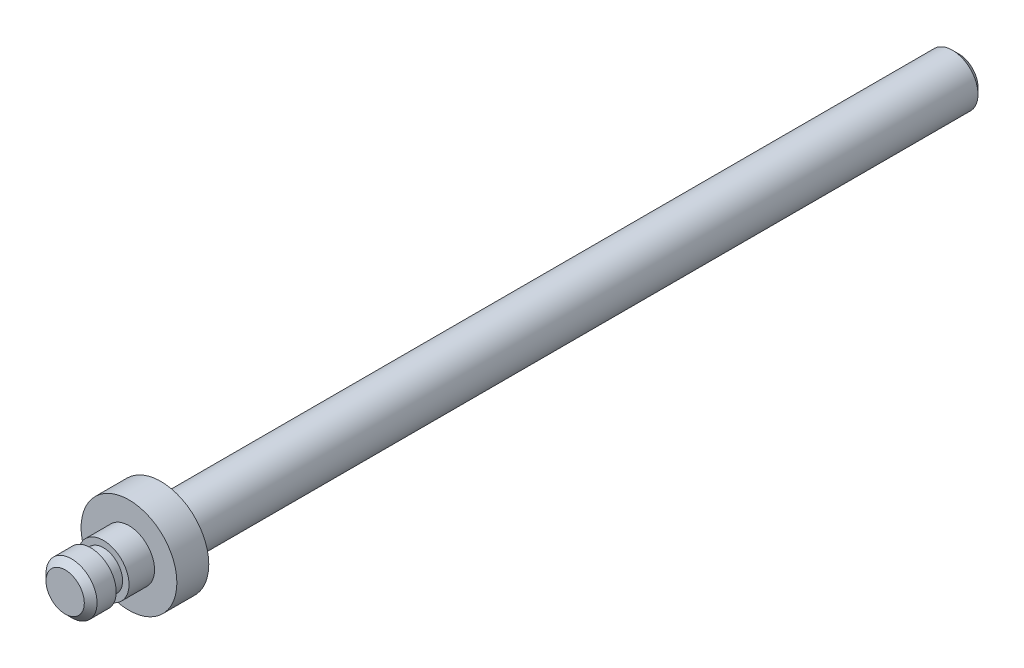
from build123d import *

# Parameters (mm, degrees)
SKETCH_1_R          = 4
EXTRUDE_1_DEPTH     = 125
SKETCH_2_R          = 7.5
EXTRUDE_2_DEPTH     = 5
SKETCH_3_R          = 4
EXTRUDE_3_DEPTH     = 10
CHAMFER_1_SIZE      = 1
CUT_EXTRUDE_START   = -6
SKETCH_5_R          = 4
SKETCH_5_R_2        = 3
CUT_EXTRUDE_2_DEPTH = 2


with BuildPart() as part:
    # Sketch 1 → Extrude 1 (new body)
    with BuildSketch(Plane.XY):
        Circle(SKETCH_1_R)
    extrude(amount=EXTRUDE_1_DEPTH)

    # Sketch 2 → Extrude 2 (add)
    with BuildSketch(Plane.XY.offset(125)):
        Circle(SKETCH_2_R)
    extrude(amount=EXTRUDE_2_DEPTH)

    # Sketch 3 → Extrude 3 (add)
    with BuildSketch(Plane.XY.offset(130)):
        Circle(SKETCH_3_R)
    extrude(amount=EXTRUDE_3_DEPTH)

    # Chamfer 1
    chamfer_1_edges = [part.edges().sort_by_distance(p)[0] for p in [
        (-4, 0, 140),
        (-4, 0, 0),
    ]]
    chamfer(chamfer_1_edges, length=CHAMFER_1_SIZE)

    # Sketch 5 → Cut-Extrude 2 (cut)
    with BuildSketch(Plane.XY.offset(140).offset(CUT_EXTRUDE_START)):
        Circle(SKETCH_5_R)
        Circle(SKETCH_5_R_2, mode=Mode.SUBTRACT)
    extrude(amount=CUT_EXTRUDE_2_DEPTH, mode=Mode.SUBTRACT)


solid = part.part
